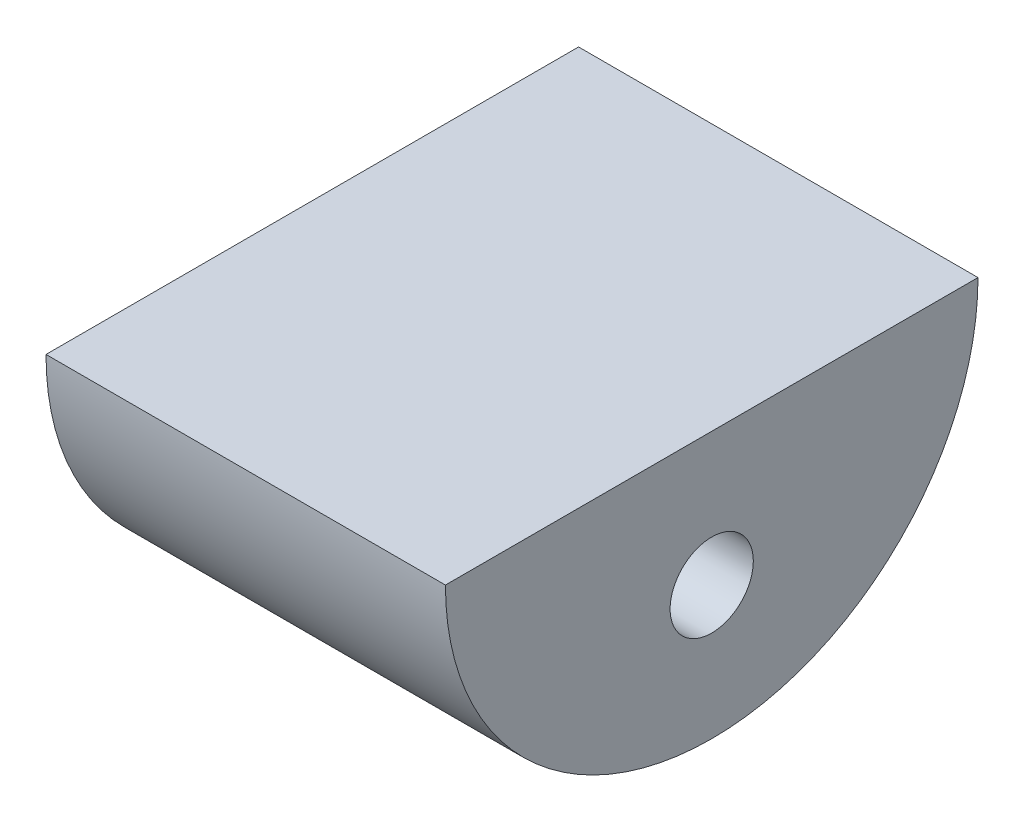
ISO-10303-21;
HEADER;
FILE_DESCRIPTION(('STEP AP214'),'2;1');
FILE_NAME('part.step','',(''),(''),'','','');
FILE_SCHEMA(('AUTOMOTIVE_DESIGN { 1 0 10303 214 1 1 1 1 }'));
ENDSEC;
DATA;
#1=APPLICATION_CONTEXT('core data for automotive mechanical design processes');
#2=APPLICATION_PROTOCOL_DEFINITION('international standard','automotive_design',2000,#1);
#3=PRODUCT_CONTEXT('',#1,'mechanical');
#4=PRODUCT('Part','Part','',(#3));
#5=PRODUCT_RELATED_PRODUCT_CATEGORY('part','',(#4));
#6=PRODUCT_DEFINITION_FORMATION('','',#4);
#7=PRODUCT_DEFINITION_CONTEXT('part definition',#1,'design');
#8=PRODUCT_DEFINITION('design','',#6,#7);
#9=PRODUCT_DEFINITION_SHAPE('','',#8);
#10=(LENGTH_UNIT() NAMED_UNIT(*) SI_UNIT(.MILLI.,.METRE.));
#11=(NAMED_UNIT(*) PLANE_ANGLE_UNIT() SI_UNIT($,.RADIAN.));
#12=(NAMED_UNIT(*) SI_UNIT($,.STERADIAN.) SOLID_ANGLE_UNIT());
#13=UNCERTAINTY_MEASURE_WITH_UNIT(LENGTH_MEASURE(1.E-05),#10,'distance_accuracy_value','');
#14=(GEOMETRIC_REPRESENTATION_CONTEXT(3) GLOBAL_UNCERTAINTY_ASSIGNED_CONTEXT((#13)) GLOBAL_UNIT_ASSIGNED_CONTEXT((#10,
#11,#12)) REPRESENTATION_CONTEXT('',''));
#15=CARTESIAN_POINT('',(0.,0.,0.));
#16=DIRECTION('',(0.,0.,1.));
#17=DIRECTION('',(1.,0.,0.));
#18=AXIS2_PLACEMENT_3D('',#15,#16,#17);
#19=CARTESIAN_POINT('',(-120.,40.,0.));
#20=DIRECTION('',(1.,0.,0.));
#21=DIRECTION('',(0.,0.,-1.));
#22=AXIS2_PLACEMENT_3D('',#19,#20,#21);
#23=CYLINDRICAL_SURFACE('',#22,80.0000000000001);
#24=CARTESIAN_POINT('',(0.,40.,0.));
#25=DIRECTION('',(1.,0.,0.));
#26=DIRECTION('',(0.,0.,-1.));
#27=AXIS2_PLACEMENT_3D('',#24,#25,#26);
#28=CIRCLE('',#27,80.0000000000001);
#29=CARTESIAN_POINT('',(0.,40.,80.0000000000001));
#30=VERTEX_POINT('',#29);
#31=CARTESIAN_POINT('',(0.,40.,-80.0000000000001));
#32=VERTEX_POINT('',#31);
#33=EDGE_CURVE('E74',#30,#32,#28,.T.);
#34=ORIENTED_EDGE('',*,*,#33,.F.);
#35=DIRECTION('',(1.,0.,0.));
#36=VECTOR('',#35,1.);
#37=CARTESIAN_POINT('',(-120.,40.,80.0000000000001));
#38=LINE('',#37,#36);
#39=CARTESIAN_POINT('',(-120.,40.,80.0000000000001));
#40=VERTEX_POINT('',#39);
#41=EDGE_CURVE('E11',#40,#30,#38,.T.);
#42=ORIENTED_EDGE('',*,*,#41,.F.);
#43=CARTESIAN_POINT('',(-120.,40.,0.));
#44=DIRECTION('',(1.,0.,0.));
#45=DIRECTION('',(0.,0.,-1.));
#46=AXIS2_PLACEMENT_3D('',#43,#44,#45);
#47=CIRCLE('',#46,80.0000000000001);
#48=CARTESIAN_POINT('',(-120.,40.,-80.0000000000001));
#49=VERTEX_POINT('',#48);
#50=EDGE_CURVE('E79',#40,#49,#47,.T.);
#51=ORIENTED_EDGE('',*,*,#50,.T.);
#52=DIRECTION('',(1.,0.,0.));
#53=VECTOR('',#52,1.);
#54=CARTESIAN_POINT('',(-120.,40.,-80.0000000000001));
#55=LINE('',#54,#53);
#56=EDGE_CURVE('E48',#49,#32,#55,.T.);
#57=ORIENTED_EDGE('',*,*,#56,.T.);
#58=EDGE_LOOP('',(#34,#42,#51,#57));
#59=FACE_BOUND('',#58,.T.);
#60=ADVANCED_FACE('F45',(#59),#23,.T.);
#61=CARTESIAN_POINT('',(-120.,40.,-80.0000000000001));
#62=DIRECTION('',(0.,1.,0.));
#63=DIRECTION('',(0.,0.,1.));
#64=AXIS2_PLACEMENT_3D('',#61,#62,#63);
#65=PLANE('',#64);
#66=DIRECTION('',(0.,0.,1.));
#67=VECTOR('',#66,1.);
#68=CARTESIAN_POINT('',(0.,40.,-80.0000000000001));
#69=LINE('',#68,#67);
#70=EDGE_CURVE('E71',#32,#30,#69,.T.);
#71=ORIENTED_EDGE('',*,*,#70,.F.);
#72=ORIENTED_EDGE('',*,*,#56,.F.);
#73=DIRECTION('',(0.,0.,1.));
#74=VECTOR('',#73,1.);
#75=CARTESIAN_POINT('',(-120.,40.,-80.0000000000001));
#76=LINE('',#75,#74);
#77=EDGE_CURVE('E73',#49,#40,#76,.T.);
#78=ORIENTED_EDGE('',*,*,#77,.T.);
#79=ORIENTED_EDGE('',*,*,#41,.T.);
#80=EDGE_LOOP('',(#71,#72,#78,#79));
#81=FACE_BOUND('',#80,.T.);
#82=ADVANCED_FACE('F69',(#81),#65,.T.);
#83=CARTESIAN_POINT('',(-120.,40.,0.));
#84=DIRECTION('',(1.,0.,0.));
#85=DIRECTION('',(0.,0.,-1.));
#86=AXIS2_PLACEMENT_3D('',#83,#84,#85);
#87=PLANE('',#86);
#88=ORIENTED_EDGE('',*,*,#50,.F.);
#89=ORIENTED_EDGE('',*,*,#77,.F.);
#90=EDGE_LOOP('',(#88,#89));
#91=FACE_BOUND('',#90,.T.);
#92=ADVANCED_FACE('F99',(#91),#87,.F.);
#93=CARTESIAN_POINT('',(0.,40.,0.));
#94=DIRECTION('',(1.,0.,0.));
#95=DIRECTION('',(0.,0.,-1.));
#96=AXIS2_PLACEMENT_3D('',#93,#94,#95);
#97=PLANE('',#96);
#98=CARTESIAN_POINT('',(0.,0.,0.));
#99=DIRECTION('',(1.,0.,0.));
#100=DIRECTION('',(0.,0.,-1.));
#101=AXIS2_PLACEMENT_3D('',#98,#99,#100);
#102=CIRCLE('',#101,12.5);
#103=CARTESIAN_POINT('',(0.,0.,-12.5));
#104=VERTEX_POINT('',#103);
#105=EDGE_CURVE('E84',#104,#104,#102,.T.);
#106=ORIENTED_EDGE('',*,*,#105,.F.);
#107=EDGE_LOOP('',(#106));
#108=FACE_BOUND('',#107,.T.);
#109=ORIENTED_EDGE('',*,*,#33,.T.);
#110=ORIENTED_EDGE('',*,*,#70,.T.);
#111=EDGE_LOOP('',(#109,#110));
#112=FACE_BOUND('',#111,.T.);
#113=ADVANCED_FACE('F78',(#108,#112),#97,.T.);
#114=CARTESIAN_POINT('',(-20.,0.,0.));
#115=DIRECTION('',(1.,0.,0.));
#116=DIRECTION('',(0.,0.,-1.));
#117=AXIS2_PLACEMENT_3D('',#114,#115,#116);
#118=CYLINDRICAL_SURFACE('',#117,12.5);
#119=CARTESIAN_POINT('',(-20.,0.,0.));
#120=DIRECTION('',(1.,0.,0.));
#121=DIRECTION('',(0.,0.,-1.));
#122=AXIS2_PLACEMENT_3D('',#119,#120,#121);
#123=CIRCLE('',#122,12.5);
#124=CARTESIAN_POINT('',(-20.,0.,-12.5));
#125=VERTEX_POINT('',#124);
#126=EDGE_CURVE('E76',#125,#125,#123,.T.);
#127=ORIENTED_EDGE('',*,*,#126,.F.);
#128=EDGE_LOOP('',(#127));
#129=FACE_BOUND('',#128,.T.);
#130=ORIENTED_EDGE('',*,*,#105,.T.);
#131=EDGE_LOOP('',(#130));
#132=FACE_BOUND('',#131,.T.);
#133=ADVANCED_FACE('F92',(#129,#132),#118,.F.);
#134=CARTESIAN_POINT('',(-20.,0.,0.));
#135=DIRECTION('',(1.,0.,0.));
#136=DIRECTION('',(0.,0.,-1.));
#137=AXIS2_PLACEMENT_3D('',#134,#135,#136);
#138=PLANE('',#137);
#139=ORIENTED_EDGE('',*,*,#126,.T.);
#140=EDGE_LOOP('',(#139));
#141=FACE_BOUND('',#140,.T.);
#142=ADVANCED_FACE('F90',(#141),#138,.T.);
#143=CLOSED_SHELL('',(#60,#82,#92,#113,#133,#142));
#144=MANIFOLD_SOLID_BREP('B2',#143);
#145=ADVANCED_BREP_SHAPE_REPRESENTATION('',(#18,#144),#14);
#146=SHAPE_DEFINITION_REPRESENTATION(#9,#145);
ENDSEC;
END-ISO-10303-21;
